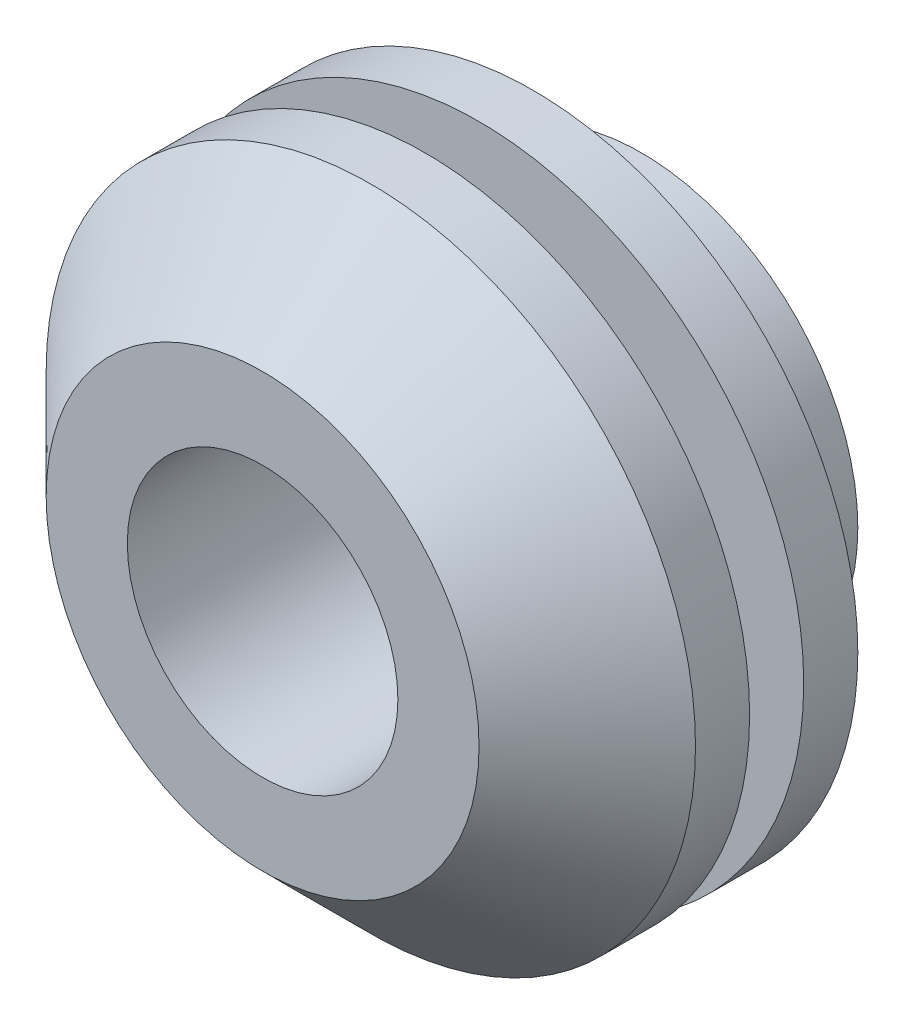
ISO-10303-21;
HEADER;
FILE_DESCRIPTION(('STEP AP214'),'2;1');
FILE_NAME('part.step','',(''),(''),'','','');
FILE_SCHEMA(('AUTOMOTIVE_DESIGN { 1 0 10303 214 1 1 1 1 }'));
ENDSEC;
DATA;
#1=APPLICATION_CONTEXT('core data for automotive mechanical design processes');
#2=APPLICATION_PROTOCOL_DEFINITION('international standard','automotive_design',2000,#1);
#3=PRODUCT_CONTEXT('',#1,'mechanical');
#4=PRODUCT('Part','Part','',(#3));
#5=PRODUCT_RELATED_PRODUCT_CATEGORY('part','',(#4));
#6=PRODUCT_DEFINITION_FORMATION('','',#4);
#7=PRODUCT_DEFINITION_CONTEXT('part definition',#1,'design');
#8=PRODUCT_DEFINITION('design','',#6,#7);
#9=PRODUCT_DEFINITION_SHAPE('','',#8);
#10=(LENGTH_UNIT() NAMED_UNIT(*) SI_UNIT(.MILLI.,.METRE.));
#11=(NAMED_UNIT(*) PLANE_ANGLE_UNIT() SI_UNIT($,.RADIAN.));
#12=(NAMED_UNIT(*) SI_UNIT($,.STERADIAN.) SOLID_ANGLE_UNIT());
#13=UNCERTAINTY_MEASURE_WITH_UNIT(LENGTH_MEASURE(1.E-05),#10,'distance_accuracy_value','');
#14=(GEOMETRIC_REPRESENTATION_CONTEXT(3) GLOBAL_UNCERTAINTY_ASSIGNED_CONTEXT((#13)) GLOBAL_UNIT_ASSIGNED_CONTEXT((#10,
#11,#12)) REPRESENTATION_CONTEXT('',''));
#15=CARTESIAN_POINT('',(0.,0.,0.));
#16=DIRECTION('',(0.,0.,1.));
#17=DIRECTION('',(1.,0.,0.));
#18=AXIS2_PLACEMENT_3D('',#15,#16,#17);
#19=CARTESIAN_POINT('',(0.,0.,1.5));
#20=DIRECTION('',(0.,0.,1.));
#21=DIRECTION('',(1.,0.,0.));
#22=AXIS2_PLACEMENT_3D('',#19,#20,#21);
#23=PLANE('',#22);
#24=CARTESIAN_POINT('',(0.,0.,1.5));
#25=DIRECTION('',(0.,0.,1.));
#26=DIRECTION('',(1.,0.,0.));
#27=AXIS2_PLACEMENT_3D('',#24,#25,#26);
#28=CIRCLE('',#27,3.);
#29=CARTESIAN_POINT('',(3.,0.,1.5));
#30=VERTEX_POINT('',#29);
#31=EDGE_CURVE('E50',#30,#30,#28,.T.);
#32=ORIENTED_EDGE('',*,*,#31,.T.);
#33=EDGE_LOOP('',(#32));
#34=FACE_BOUND('',#33,.T.);
#35=CARTESIAN_POINT('',(0.,0.,1.5));
#36=DIRECTION('',(0.,0.,1.));
#37=DIRECTION('',(1.,0.,0.));
#38=AXIS2_PLACEMENT_3D('',#35,#36,#37);
#39=CIRCLE('',#38,2.);
#40=CARTESIAN_POINT('',(2.,0.,1.5));
#41=VERTEX_POINT('',#40);
#42=EDGE_CURVE('E59',#41,#41,#39,.T.);
#43=ORIENTED_EDGE('',*,*,#42,.F.);
#44=EDGE_LOOP('',(#43));
#45=FACE_BOUND('',#44,.T.);
#46=ADVANCED_FACE('F30',(#34,#45),#23,.T.);
#47=CARTESIAN_POINT('',(0.,0.,1.));
#48=DIRECTION('',(0.,0.,-1.));
#49=DIRECTION('',(-1.,0.,0.));
#50=AXIS2_PLACEMENT_3D('',#47,#48,#49);
#51=CYLINDRICAL_SURFACE('',#50,2.);
#52=CARTESIAN_POINT('',(0.,0.,1.));
#53=DIRECTION('',(0.,0.,1.));
#54=DIRECTION('',(1.,0.,0.));
#55=AXIS2_PLACEMENT_3D('',#52,#53,#54);
#56=CIRCLE('',#55,2.);
#57=CARTESIAN_POINT('',(2.,0.,1.));
#58=VERTEX_POINT('',#57);
#59=EDGE_CURVE('E41',#58,#58,#56,.T.);
#60=ORIENTED_EDGE('',*,*,#59,.F.);
#61=EDGE_LOOP('',(#60));
#62=FACE_BOUND('',#61,.T.);
#63=CARTESIAN_POINT('',(0.,0.,0.));
#64=DIRECTION('',(0.,0.,1.));
#65=DIRECTION('',(1.,0.,0.));
#66=AXIS2_PLACEMENT_3D('',#63,#64,#65);
#67=CIRCLE('',#66,2.);
#68=CARTESIAN_POINT('',(2.,0.,0.));
#69=VERTEX_POINT('',#68);
#70=EDGE_CURVE('E45',#69,#69,#67,.T.);
#71=ORIENTED_EDGE('',*,*,#70,.T.);
#72=EDGE_LOOP('',(#71));
#73=FACE_BOUND('',#72,.T.);
#74=ADVANCED_FACE('F32',(#62,#73),#51,.T.);
#75=CARTESIAN_POINT('',(0.,0.,0.));
#76=DIRECTION('',(0.,0.,1.));
#77=DIRECTION('',(1.,0.,0.));
#78=AXIS2_PLACEMENT_3D('',#75,#76,#77);
#79=PLANE('',#78);
#80=CARTESIAN_POINT('',(0.,0.,0.));
#81=DIRECTION('',(0.,0.,1.));
#82=DIRECTION('',(1.,0.,0.));
#83=AXIS2_PLACEMENT_3D('',#80,#81,#82);
#84=CIRCLE('',#83,1.25);
#85=CARTESIAN_POINT('',(1.25,0.,0.));
#86=VERTEX_POINT('',#85);
#87=EDGE_CURVE('E65',#86,#86,#84,.T.);
#88=ORIENTED_EDGE('',*,*,#87,.T.);
#89=EDGE_LOOP('',(#88));
#90=FACE_BOUND('',#89,.T.);
#91=ORIENTED_EDGE('',*,*,#70,.F.);
#92=EDGE_LOOP('',(#91));
#93=FACE_BOUND('',#92,.T.);
#94=ADVANCED_FACE('F94',(#90,#93),#79,.F.);
#95=CARTESIAN_POINT('',(0.,0.,1.));
#96=DIRECTION('',(0.,0.,1.));
#97=DIRECTION('',(1.,0.,0.));
#98=AXIS2_PLACEMENT_3D('',#95,#96,#97);
#99=PLANE('',#98);
#100=CARTESIAN_POINT('',(0.,0.,1.));
#101=DIRECTION('',(0.,0.,1.));
#102=DIRECTION('',(1.,0.,0.));
#103=AXIS2_PLACEMENT_3D('',#100,#101,#102);
#104=CIRCLE('',#103,3.);
#105=CARTESIAN_POINT('',(3.,0.,1.));
#106=VERTEX_POINT('',#105);
#107=EDGE_CURVE('E53',#106,#106,#104,.T.);
#108=ORIENTED_EDGE('',*,*,#107,.F.);
#109=EDGE_LOOP('',(#108));
#110=FACE_BOUND('',#109,.T.);
#111=ORIENTED_EDGE('',*,*,#59,.T.);
#112=EDGE_LOOP('',(#111));
#113=FACE_BOUND('',#112,.T.);
#114=ADVANCED_FACE('F99',(#110,#113),#99,.F.);
#115=CARTESIAN_POINT('',(0.,0.,1.5));
#116=DIRECTION('',(0.,0.,-1.));
#117=DIRECTION('',(-1.,0.,0.));
#118=AXIS2_PLACEMENT_3D('',#115,#116,#117);
#119=CYLINDRICAL_SURFACE('',#118,3.);
#120=ORIENTED_EDGE('',*,*,#31,.F.);
#121=EDGE_LOOP('',(#120));
#122=FACE_BOUND('',#121,.T.);
#123=ORIENTED_EDGE('',*,*,#107,.T.);
#124=EDGE_LOOP('',(#123));
#125=FACE_BOUND('',#124,.T.);
#126=ADVANCED_FACE('F101',(#122,#125),#119,.T.);
#127=CARTESIAN_POINT('',(0.,0.,2.));
#128=DIRECTION('',(0.,0.,-1.));
#129=DIRECTION('',(-1.,0.,0.));
#130=AXIS2_PLACEMENT_3D('',#127,#128,#129);
#131=CYLINDRICAL_SURFACE('',#130,2.);
#132=CARTESIAN_POINT('',(0.,0.,2.));
#133=DIRECTION('',(0.,0.,1.));
#134=DIRECTION('',(1.,0.,0.));
#135=AXIS2_PLACEMENT_3D('',#132,#133,#134);
#136=CIRCLE('',#135,2.);
#137=CARTESIAN_POINT('',(2.,0.,2.));
#138=VERTEX_POINT('',#137);
#139=EDGE_CURVE('E56',#138,#138,#136,.T.);
#140=ORIENTED_EDGE('',*,*,#139,.F.);
#141=EDGE_LOOP('',(#140));
#142=FACE_BOUND('',#141,.T.);
#143=ORIENTED_EDGE('',*,*,#42,.T.);
#144=EDGE_LOOP('',(#143));
#145=FACE_BOUND('',#144,.T.);
#146=ADVANCED_FACE('F103',(#142,#145),#131,.T.);
#147=CARTESIAN_POINT('',(0.,0.,2.));
#148=DIRECTION('',(0.,0.,1.));
#149=DIRECTION('',(1.,0.,0.));
#150=AXIS2_PLACEMENT_3D('',#147,#148,#149);
#151=PLANE('',#150);
#152=CARTESIAN_POINT('',(0.,0.,2.));
#153=DIRECTION('',(0.,0.,1.));
#154=DIRECTION('',(1.,0.,0.));
#155=AXIS2_PLACEMENT_3D('',#152,#153,#154);
#156=CIRCLE('',#155,3.);
#157=CARTESIAN_POINT('',(3.,0.,2.));
#158=VERTEX_POINT('',#157);
#159=EDGE_CURVE('E62',#158,#158,#156,.T.);
#160=ORIENTED_EDGE('',*,*,#159,.F.);
#161=EDGE_LOOP('',(#160));
#162=FACE_BOUND('',#161,.T.);
#163=ORIENTED_EDGE('',*,*,#139,.T.);
#164=EDGE_LOOP('',(#163));
#165=FACE_BOUND('',#164,.T.);
#166=ADVANCED_FACE('F85',(#162,#165),#151,.F.);
#167=CARTESIAN_POINT('',(0.,0.,3.5));
#168=DIRECTION('',(0.,0.,-1.));
#169=DIRECTION('',(-1.,0.,0.));
#170=AXIS2_PLACEMENT_3D('',#167,#168,#169);
#171=CYLINDRICAL_SURFACE('',#170,3.);
#172=CARTESIAN_POINT('',(0.,0.,2.5));
#173=DIRECTION('',(0.,0.,1.));
#174=DIRECTION('',(1.,0.,0.));
#175=AXIS2_PLACEMENT_3D('',#172,#173,#174);
#176=CIRCLE('',#175,3.);
#177=CARTESIAN_POINT('',(3.,0.,2.5));
#178=VERTEX_POINT('',#177);
#179=EDGE_CURVE('E10',#178,#178,#176,.F.);
#180=ORIENTED_EDGE('',*,*,#179,.T.);
#181=EDGE_LOOP('',(#180));
#182=FACE_BOUND('',#181,.T.);
#183=ORIENTED_EDGE('',*,*,#159,.T.);
#184=EDGE_LOOP('',(#183));
#185=FACE_BOUND('',#184,.T.);
#186=ADVANCED_FACE('F77',(#182,#185),#171,.T.);
#187=CARTESIAN_POINT('',(0.,0.,3.5));
#188=DIRECTION('',(0.,0.,1.));
#189=DIRECTION('',(1.,0.,0.));
#190=AXIS2_PLACEMENT_3D('',#187,#188,#189);
#191=PLANE('',#190);
#192=CARTESIAN_POINT('',(0.,0.,3.5));
#193=DIRECTION('',(0.,0.,1.));
#194=DIRECTION('',(1.,0.,0.));
#195=AXIS2_PLACEMENT_3D('',#192,#193,#194);
#196=CIRCLE('',#195,1.25);
#197=CARTESIAN_POINT('',(1.25,0.,3.5));
#198=VERTEX_POINT('',#197);
#199=EDGE_CURVE('E68',#198,#198,#196,.T.);
#200=ORIENTED_EDGE('',*,*,#199,.F.);
#201=EDGE_LOOP('',(#200));
#202=FACE_BOUND('',#201,.T.);
#203=CARTESIAN_POINT('',(0.,0.,3.5));
#204=DIRECTION('',(0.,0.,1.));
#205=DIRECTION('',(1.,0.,0.));
#206=AXIS2_PLACEMENT_3D('',#203,#204,#205);
#207=CIRCLE('',#206,2.);
#208=CARTESIAN_POINT('',(2.,0.,3.5));
#209=VERTEX_POINT('',#208);
#210=EDGE_CURVE('E37',#209,#209,#207,.T.);
#211=ORIENTED_EDGE('',*,*,#210,.T.);
#212=EDGE_LOOP('',(#211));
#213=FACE_BOUND('',#212,.T.);
#214=ADVANCED_FACE('F74',(#202,#213),#191,.T.);
#215=CARTESIAN_POINT('',(0.,0.,3.5));
#216=DIRECTION('',(0.,0.,-1.));
#217=DIRECTION('',(-1.,0.,0.));
#218=AXIS2_PLACEMENT_3D('',#215,#216,#217);
#219=CONICAL_SURFACE('',#218,2.,0.785398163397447);
#220=ORIENTED_EDGE('',*,*,#179,.F.);
#221=EDGE_LOOP('',(#220));
#222=FACE_BOUND('',#221,.T.);
#223=ORIENTED_EDGE('',*,*,#210,.F.);
#224=EDGE_LOOP('',(#223));
#225=FACE_BOUND('',#224,.T.);
#226=ADVANCED_FACE('F76',(#222,#225),#219,.T.);
#227=CARTESIAN_POINT('',(0.,0.,0.));
#228=DIRECTION('',(0.,0.,1.));
#229=DIRECTION('',(1.,0.,0.));
#230=AXIS2_PLACEMENT_3D('',#227,#228,#229);
#231=CYLINDRICAL_SURFACE('',#230,1.25);
#232=ORIENTED_EDGE('',*,*,#87,.F.);
#233=EDGE_LOOP('',(#232));
#234=FACE_BOUND('',#233,.T.);
#235=ORIENTED_EDGE('',*,*,#199,.T.);
#236=EDGE_LOOP('',(#235));
#237=FACE_BOUND('',#236,.T.);
#238=ADVANCED_FACE('F72',(#234,#237),#231,.F.);
#239=CLOSED_SHELL('',(#46,#74,#94,#114,#126,#146,#166,#186,#214,#226,#238));
#240=MANIFOLD_SOLID_BREP('B2',#239);
#241=ADVANCED_BREP_SHAPE_REPRESENTATION('',(#18,#240),#14);
#242=SHAPE_DEFINITION_REPRESENTATION(#9,#241);
ENDSEC;
END-ISO-10303-21;
